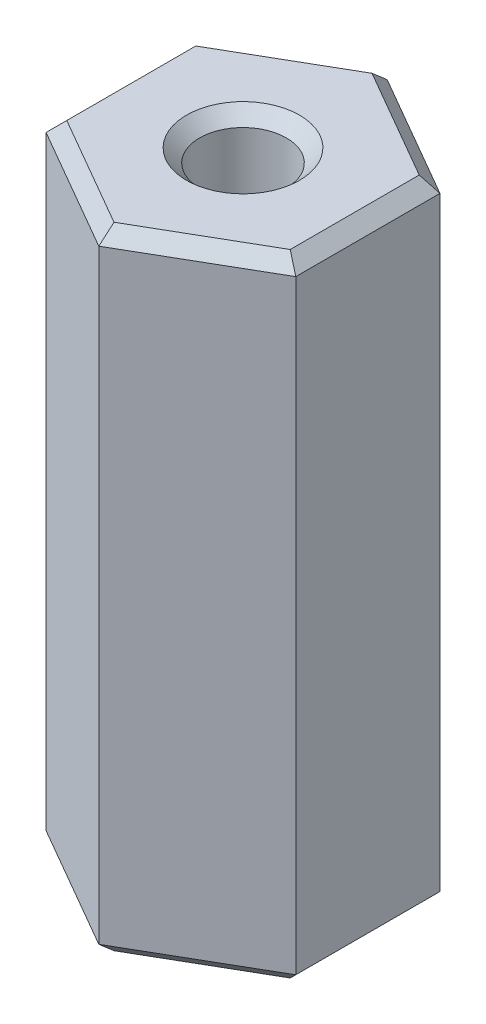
ISO-10303-21;
HEADER;
FILE_DESCRIPTION(('STEP AP214'),'2;1');
FILE_NAME('part.step','',(''),(''),'','','');
FILE_SCHEMA(('AUTOMOTIVE_DESIGN { 1 0 10303 214 1 1 1 1 }'));
ENDSEC;
DATA;
#1=APPLICATION_CONTEXT('core data for automotive mechanical design processes');
#2=APPLICATION_PROTOCOL_DEFINITION('international standard','automotive_design',2000,#1);
#3=PRODUCT_CONTEXT('',#1,'mechanical');
#4=PRODUCT('Part','Part','',(#3));
#5=PRODUCT_RELATED_PRODUCT_CATEGORY('part','',(#4));
#6=PRODUCT_DEFINITION_FORMATION('','',#4);
#7=PRODUCT_DEFINITION_CONTEXT('part definition',#1,'design');
#8=PRODUCT_DEFINITION('design','',#6,#7);
#9=PRODUCT_DEFINITION_SHAPE('','',#8);
#10=(LENGTH_UNIT() NAMED_UNIT(*) SI_UNIT(.MILLI.,.METRE.));
#11=(NAMED_UNIT(*) PLANE_ANGLE_UNIT() SI_UNIT($,.RADIAN.));
#12=(NAMED_UNIT(*) SI_UNIT($,.STERADIAN.) SOLID_ANGLE_UNIT());
#13=UNCERTAINTY_MEASURE_WITH_UNIT(LENGTH_MEASURE(1.E-05),#10,'distance_accuracy_value','');
#14=(GEOMETRIC_REPRESENTATION_CONTEXT(3) GLOBAL_UNCERTAINTY_ASSIGNED_CONTEXT((#13)) GLOBAL_UNIT_ASSIGNED_CONTEXT((#10,
#11,#12)) REPRESENTATION_CONTEXT('',''));
#15=CARTESIAN_POINT('',(0.,0.,0.));
#16=DIRECTION('',(0.,0.,1.));
#17=DIRECTION('',(1.,0.,0.));
#18=AXIS2_PLACEMENT_3D('',#15,#16,#17);
#19=CARTESIAN_POINT('',(-12.925,0.,0.));
#20=DIRECTION('',(0.,1.,0.));
#21=DIRECTION('',(0.,0.,1.));
#22=AXIS2_PLACEMENT_3D('',#19,#20,#21);
#23=PLANE('',#22);
#24=DIRECTION('',(0.,0.,-1.));
#25=VECTOR('',#24,1.);
#26=CARTESIAN_POINT('',(-8.49999999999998,0.,-5.48482755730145));
#27=LINE('',#26,#25);
#28=CARTESIAN_POINT('',(-8.49999999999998,0.,4.90747728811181));
#29=VERTEX_POINT('',#28);
#30=CARTESIAN_POINT('',(-8.49999999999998,0.,-4.90747728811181));
#31=VERTEX_POINT('',#30);
#32=EDGE_CURVE('E162',#29,#31,#27,.T.);
#33=ORIENTED_EDGE('',*,*,#32,.T.);
#34=DIRECTION('',(0.866025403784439,0.,-0.5));
#35=VECTOR('',#34,1.);
#36=CARTESIAN_POINT('',(0.500000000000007,0.,-10.1036297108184));
#37=LINE('',#36,#35);
#38=CARTESIAN_POINT('',(0.,0.,-9.81495457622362));
#39=VERTEX_POINT('',#38);
#40=EDGE_CURVE('E164',#31,#39,#37,.T.);
#41=ORIENTED_EDGE('',*,*,#40,.T.);
#42=DIRECTION('',(0.866025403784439,0.,0.5));
#43=VECTOR('',#42,1.);
#44=CARTESIAN_POINT('',(8.99999999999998,0.,-4.618802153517));
#45=LINE('',#44,#43);
#46=CARTESIAN_POINT('',(8.49999999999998,0.,-4.90747728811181));
#47=VERTEX_POINT('',#46);
#48=EDGE_CURVE('E154',#39,#47,#45,.T.);
#49=ORIENTED_EDGE('',*,*,#48,.T.);
#50=DIRECTION('',(0.,0.,1.));
#51=VECTOR('',#50,1.);
#52=CARTESIAN_POINT('',(8.49999999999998,0.,5.48482755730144));
#53=LINE('',#52,#51);
#54=CARTESIAN_POINT('',(8.49999999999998,0.,4.90747728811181));
#55=VERTEX_POINT('',#54);
#56=EDGE_CURVE('E156',#47,#55,#53,.T.);
#57=ORIENTED_EDGE('',*,*,#56,.T.);
#58=DIRECTION('',(-0.866025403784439,0.,0.5));
#59=VECTOR('',#58,1.);
#60=CARTESIAN_POINT('',(-0.50000000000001,0.,10.1036297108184));
#61=LINE('',#60,#59);
#62=CARTESIAN_POINT('',(0.,0.,9.81495457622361));
#63=VERTEX_POINT('',#62);
#64=EDGE_CURVE('E158',#55,#63,#61,.T.);
#65=ORIENTED_EDGE('',*,*,#64,.T.);
#66=DIRECTION('',(-0.866025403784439,0.,-0.5));
#67=VECTOR('',#66,1.);
#68=CARTESIAN_POINT('',(-8.99999999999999,0.,4.61880215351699));
#69=LINE('',#68,#67);
#70=EDGE_CURVE('E160',#63,#29,#69,.T.);
#71=ORIENTED_EDGE('',*,*,#70,.T.);
#72=EDGE_LOOP('',(#33,#41,#49,#57,#65,#71));
#73=FACE_BOUND('',#72,.T.);
#74=CARTESIAN_POINT('',(0.,0.,0.));
#75=DIRECTION('',(0.,1.,0.));
#76=DIRECTION('',(0.,0.,1.));
#77=AXIS2_PLACEMENT_3D('',#74,#75,#76);
#78=CIRCLE('',#77,3.925);
#79=CARTESIAN_POINT('',(0.,0.,3.925));
#80=VERTEX_POINT('',#79);
#81=EDGE_CURVE('E151',#80,#80,#78,.T.);
#82=ORIENTED_EDGE('',*,*,#81,.T.);
#83=EDGE_LOOP('',(#82));
#84=FACE_BOUND('',#83,.T.);
#85=ADVANCED_FACE('F34',(#73,#84),#23,.F.);
#86=CARTESIAN_POINT('',(0.,0.,0.));
#87=DIRECTION('',(0.,-1.,0.));
#88=DIRECTION('',(0.,0.,-1.));
#89=AXIS2_PLACEMENT_3D('',#86,#87,#88);
#90=CYLINDRICAL_SURFACE('',#89,2.925);
#91=CARTESIAN_POINT('',(0.,1.,0.));
#92=DIRECTION('',(0.,1.,0.));
#93=DIRECTION('',(0.,0.,1.));
#94=AXIS2_PLACEMENT_3D('',#91,#92,#93);
#95=CIRCLE('',#94,2.925);
#96=CARTESIAN_POINT('',(0.,1.,2.925));
#97=VERTEX_POINT('',#96);
#98=EDGE_CURVE('E188',#97,#97,#95,.F.);
#99=ORIENTED_EDGE('',*,*,#98,.T.);
#100=EDGE_LOOP('',(#99));
#101=FACE_BOUND('',#100,.T.);
#102=CARTESIAN_POINT('',(0.,20.,0.));
#103=DIRECTION('',(0.,-1.,0.));
#104=DIRECTION('',(0.,0.,-1.));
#105=AXIS2_PLACEMENT_3D('',#102,#103,#104);
#106=CIRCLE('',#105,2.925);
#107=CARTESIAN_POINT('',(0.,20.,-2.925));
#108=VERTEX_POINT('',#107);
#109=EDGE_CURVE('E137',#108,#108,#106,.T.);
#110=ORIENTED_EDGE('',*,*,#109,.F.);
#111=EDGE_LOOP('',(#110));
#112=FACE_BOUND('',#111,.T.);
#113=ADVANCED_FACE('F133',(#101,#112),#90,.F.);
#114=CARTESIAN_POINT('',(0.,20.,0.));
#115=DIRECTION('',(0.,-1.,0.));
#116=DIRECTION('',(0.,0.,-1.));
#117=AXIS2_PLACEMENT_3D('',#114,#115,#116);
#118=CONICAL_SURFACE('',#117,2.925,0.785398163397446);
#119=CARTESIAN_POINT('',(0.,22.925,0.));
#120=VERTEX_POINT('',#119);
#121=VERTEX_LOOP('',#120);
#122=FACE_BOUND('',#121,.T.);
#123=ORIENTED_EDGE('',*,*,#109,.T.);
#124=EDGE_LOOP('',(#123));
#125=FACE_BOUND('',#124,.T.);
#126=ADVANCED_FACE('F129',(#122,#125),#118,.F.);
#127=CARTESIAN_POINT('',(9.49999999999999,0.,-5.48482755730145));
#128=DIRECTION('',(0.5,0.,-0.866025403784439));
#129=DIRECTION('',(-0.866025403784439,0.,-0.5));
#130=AXIS2_PLACEMENT_3D('',#127,#128,#129);
#131=PLANE('',#130);
#132=DIRECTION('',(0.,1.,0.));
#133=VECTOR('',#132,1.);
#134=CARTESIAN_POINT('',(9.49999999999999,0.,-5.48482755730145));
#135=LINE('',#134,#133);
#136=CARTESIAN_POINT('',(9.49999999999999,1.00000000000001,-5.48482755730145));
#137=VERTEX_POINT('',#136);
#138=CARTESIAN_POINT('',(9.49999999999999,47.,-5.48482755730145));
#139=VERTEX_POINT('',#138);
#140=EDGE_CURVE('E145',#137,#139,#135,.T.);
#141=ORIENTED_EDGE('',*,*,#140,.F.);
#142=DIRECTION('',(-0.866025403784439,0.,-0.5));
#143=VECTOR('',#142,1.);
#144=CARTESIAN_POINT('',(0.,1.00000000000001,-10.9696551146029));
#145=LINE('',#144,#143);
#146=CARTESIAN_POINT('',(0.,1.00000000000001,-10.9696551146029));
#147=VERTEX_POINT('',#146);
#148=EDGE_CURVE('E186',#137,#147,#145,.T.);
#149=ORIENTED_EDGE('',*,*,#148,.T.);
#150=DIRECTION('',(0.,1.,0.));
#151=VECTOR('',#150,1.);
#152=CARTESIAN_POINT('',(0.,0.,-10.9696551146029));
#153=LINE('',#152,#151);
#154=CARTESIAN_POINT('',(0.,47.,-10.9696551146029));
#155=VERTEX_POINT('',#154);
#156=EDGE_CURVE('E219',#147,#155,#153,.T.);
#157=ORIENTED_EDGE('',*,*,#156,.T.);
#158=DIRECTION('',(0.866025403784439,0.,0.5));
#159=VECTOR('',#158,1.);
#160=CARTESIAN_POINT('',(9.49999999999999,47.,-5.48482755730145));
#161=LINE('',#160,#159);
#162=EDGE_CURVE('E184',#155,#139,#161,.T.);
#163=ORIENTED_EDGE('',*,*,#162,.T.);
#164=EDGE_LOOP('',(#141,#149,#157,#163));
#165=FACE_BOUND('',#164,.T.);
#166=ADVANCED_FACE('F132',(#165),#131,.T.);
#167=CARTESIAN_POINT('',(9.49999999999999,0.,5.48482755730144));
#168=DIRECTION('',(1.,0.,0.));
#169=DIRECTION('',(0.,0.,-1.));
#170=AXIS2_PLACEMENT_3D('',#167,#168,#169);
#171=PLANE('',#170);
#172=DIRECTION('',(0.,1.,0.));
#173=VECTOR('',#172,1.);
#174=CARTESIAN_POINT('',(9.49999999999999,0.,5.48482755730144));
#175=LINE('',#174,#173);
#176=CARTESIAN_POINT('',(9.49999999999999,1.00000000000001,5.48482755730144));
#177=VERTEX_POINT('',#176);
#178=CARTESIAN_POINT('',(9.49999999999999,47.,5.48482755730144));
#179=VERTEX_POINT('',#178);
#180=EDGE_CURVE('E264',#177,#179,#175,.T.);
#181=ORIENTED_EDGE('',*,*,#180,.F.);
#182=DIRECTION('',(0.,0.,-1.));
#183=VECTOR('',#182,1.);
#184=CARTESIAN_POINT('',(9.49999999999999,1.00000000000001,-5.48482755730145));
#185=LINE('',#184,#183);
#186=EDGE_CURVE('E182',#177,#137,#185,.T.);
#187=ORIENTED_EDGE('',*,*,#186,.T.);
#188=ORIENTED_EDGE('',*,*,#140,.T.);
#189=DIRECTION('',(0.,0.,1.));
#190=VECTOR('',#189,1.);
#191=CARTESIAN_POINT('',(9.49999999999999,47.,5.48482755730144));
#192=LINE('',#191,#190);
#193=EDGE_CURVE('E179',#139,#179,#192,.T.);
#194=ORIENTED_EDGE('',*,*,#193,.T.);
#195=EDGE_LOOP('',(#181,#187,#188,#194));
#196=FACE_BOUND('',#195,.T.);
#197=ADVANCED_FACE('F261',(#196),#171,.T.);
#198=CARTESIAN_POINT('',(0.,0.,10.9696551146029));
#199=DIRECTION('',(0.5,0.,0.866025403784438));
#200=DIRECTION('',(0.866025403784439,0.,-0.5));
#201=AXIS2_PLACEMENT_3D('',#198,#199,#200);
#202=PLANE('',#201);
#203=DIRECTION('',(0.,1.,0.));
#204=VECTOR('',#203,1.);
#205=CARTESIAN_POINT('',(0.,0.,10.9696551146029));
#206=LINE('',#205,#204);
#207=CARTESIAN_POINT('',(0.,1.00000000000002,10.9696551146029));
#208=VERTEX_POINT('',#207);
#209=CARTESIAN_POINT('',(0.,47.,10.9696551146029));
#210=VERTEX_POINT('',#209);
#211=EDGE_CURVE('E266',#208,#210,#206,.T.);
#212=ORIENTED_EDGE('',*,*,#211,.F.);
#213=DIRECTION('',(0.866025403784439,0.,-0.5));
#214=VECTOR('',#213,1.);
#215=CARTESIAN_POINT('',(9.49999999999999,1.00000000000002,5.48482755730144));
#216=LINE('',#215,#214);
#217=EDGE_CURVE('E177',#208,#177,#216,.T.);
#218=ORIENTED_EDGE('',*,*,#217,.T.);
#219=ORIENTED_EDGE('',*,*,#180,.T.);
#220=DIRECTION('',(-0.866025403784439,0.,0.5));
#221=VECTOR('',#220,1.);
#222=CARTESIAN_POINT('',(0.,47.,10.9696551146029));
#223=LINE('',#222,#221);
#224=EDGE_CURVE('E175',#179,#210,#223,.T.);
#225=ORIENTED_EDGE('',*,*,#224,.T.);
#226=EDGE_LOOP('',(#212,#218,#219,#225));
#227=FACE_BOUND('',#226,.T.);
#228=ADVANCED_FACE('F316',(#227),#202,.T.);
#229=CARTESIAN_POINT('',(-9.5,0.,5.48482755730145));
#230=DIRECTION('',(-0.5,0.,0.866025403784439));
#231=DIRECTION('',(0.866025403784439,0.,0.5));
#232=AXIS2_PLACEMENT_3D('',#229,#230,#231);
#233=PLANE('',#232);
#234=DIRECTION('',(0.,1.,0.));
#235=VECTOR('',#234,1.);
#236=CARTESIAN_POINT('',(-9.5,0.,5.48482755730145));
#237=LINE('',#236,#235);
#238=CARTESIAN_POINT('',(-9.5,1.00000000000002,5.48482755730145));
#239=VERTEX_POINT('',#238);
#240=CARTESIAN_POINT('',(-9.5,47.,5.48482755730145));
#241=VERTEX_POINT('',#240);
#242=EDGE_CURVE('E271',#239,#241,#237,.T.);
#243=ORIENTED_EDGE('',*,*,#242,.F.);
#244=DIRECTION('',(0.866025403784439,0.,0.5));
#245=VECTOR('',#244,1.);
#246=CARTESIAN_POINT('',(0.,1.00000000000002,10.9696551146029));
#247=LINE('',#246,#245);
#248=EDGE_CURVE('E173',#239,#208,#247,.T.);
#249=ORIENTED_EDGE('',*,*,#248,.T.);
#250=ORIENTED_EDGE('',*,*,#211,.T.);
#251=DIRECTION('',(-0.866025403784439,0.,-0.5));
#252=VECTOR('',#251,1.);
#253=CARTESIAN_POINT('',(-9.5,47.,5.48482755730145));
#254=LINE('',#253,#252);
#255=EDGE_CURVE('E171',#210,#241,#254,.T.);
#256=ORIENTED_EDGE('',*,*,#255,.T.);
#257=EDGE_LOOP('',(#243,#249,#250,#256));
#258=FACE_BOUND('',#257,.T.);
#259=ADVANCED_FACE('F286',(#258),#233,.T.);
#260=CARTESIAN_POINT('',(-9.5,0.,-5.48482755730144));
#261=DIRECTION('',(-1.,0.,0.));
#262=DIRECTION('',(0.,0.,1.));
#263=AXIS2_PLACEMENT_3D('',#260,#261,#262);
#264=PLANE('',#263);
#265=DIRECTION('',(0.,1.,0.));
#266=VECTOR('',#265,1.);
#267=CARTESIAN_POINT('',(-9.5,0.,-5.48482755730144));
#268=LINE('',#267,#266);
#269=CARTESIAN_POINT('',(-9.5,1.00000000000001,-5.48482755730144));
#270=VERTEX_POINT('',#269);
#271=CARTESIAN_POINT('',(-9.5,47.,-5.48482755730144));
#272=VERTEX_POINT('',#271);
#273=EDGE_CURVE('E274',#270,#272,#268,.T.);
#274=ORIENTED_EDGE('',*,*,#273,.F.);
#275=DIRECTION('',(0.,0.,1.));
#276=VECTOR('',#275,1.);
#277=CARTESIAN_POINT('',(-9.5,1.00000000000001,5.48482755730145));
#278=LINE('',#277,#276);
#279=EDGE_CURVE('E169',#270,#239,#278,.T.);
#280=ORIENTED_EDGE('',*,*,#279,.T.);
#281=ORIENTED_EDGE('',*,*,#242,.T.);
#282=DIRECTION('',(0.,0.,-1.));
#283=VECTOR('',#282,1.);
#284=CARTESIAN_POINT('',(-9.5,47.,-5.48482755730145));
#285=LINE('',#284,#283);
#286=EDGE_CURVE('E167',#241,#272,#285,.T.);
#287=ORIENTED_EDGE('',*,*,#286,.T.);
#288=EDGE_LOOP('',(#274,#280,#281,#287));
#289=FACE_BOUND('',#288,.T.);
#290=ADVANCED_FACE('F281',(#289),#264,.T.);
#291=CARTESIAN_POINT('',(0.,0.,-10.9696551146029));
#292=DIRECTION('',(-0.5,0.,-0.866025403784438));
#293=DIRECTION('',(-0.866025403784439,0.,0.5));
#294=AXIS2_PLACEMENT_3D('',#291,#292,#293);
#295=PLANE('',#294);
#296=ORIENTED_EDGE('',*,*,#156,.F.);
#297=DIRECTION('',(-0.866025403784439,0.,0.5));
#298=VECTOR('',#297,1.);
#299=CARTESIAN_POINT('',(-9.5,1.00000000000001,-5.48482755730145));
#300=LINE('',#299,#298);
#301=EDGE_CURVE('E142',#147,#270,#300,.T.);
#302=ORIENTED_EDGE('',*,*,#301,.T.);
#303=ORIENTED_EDGE('',*,*,#273,.T.);
#304=DIRECTION('',(0.866025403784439,0.,-0.5));
#305=VECTOR('',#304,1.);
#306=CARTESIAN_POINT('',(0.,47.,-10.9696551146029));
#307=LINE('',#306,#305);
#308=EDGE_CURVE('E139',#272,#155,#307,.T.);
#309=ORIENTED_EDGE('',*,*,#308,.T.);
#310=EDGE_LOOP('',(#296,#302,#303,#309));
#311=FACE_BOUND('',#310,.T.);
#312=ADVANCED_FACE('F278',(#311),#295,.T.);
#313=CARTESIAN_POINT('',(0.,24.7,0.));
#314=DIRECTION('',(0.,1.,0.));
#315=DIRECTION('',(0.,0.,1.));
#316=AXIS2_PLACEMENT_3D('',#313,#314,#315);
#317=CONICAL_SURFACE('',#316,0.,0.78539816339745);
#318=CARTESIAN_POINT('',(0.,28.,0.));
#319=DIRECTION('',(0.,-1.,0.));
#320=DIRECTION('',(0.,0.,-1.));
#321=AXIS2_PLACEMENT_3D('',#318,#319,#320);
#322=CIRCLE('',#321,3.3);
#323=CARTESIAN_POINT('',(0.,28.,-3.3));
#324=VERTEX_POINT('',#323);
#325=EDGE_CURVE('E140',#324,#324,#322,.T.);
#326=ORIENTED_EDGE('',*,*,#325,.F.);
#327=EDGE_LOOP('',(#326));
#328=FACE_BOUND('',#327,.T.);
#329=CARTESIAN_POINT('',(0.,24.7,0.));
#330=VERTEX_POINT('',#329);
#331=VERTEX_LOOP('',#330);
#332=FACE_BOUND('',#331,.T.);
#333=ADVANCED_FACE('F447',(#328,#332),#317,.F.);
#334=CARTESIAN_POINT('',(0.,0.,0.));
#335=DIRECTION('',(0.,-1.,0.));
#336=DIRECTION('',(0.,0.,-1.));
#337=AXIS2_PLACEMENT_3D('',#334,#335,#336);
#338=CYLINDRICAL_SURFACE('',#337,3.3);
#339=CARTESIAN_POINT('',(0.,47.,0.));
#340=DIRECTION('',(0.,-1.,0.));
#341=DIRECTION('',(0.,0.,-1.));
#342=AXIS2_PLACEMENT_3D('',#339,#340,#341);
#343=CIRCLE('',#342,3.3);
#344=CARTESIAN_POINT('',(0.,47.,-3.3));
#345=VERTEX_POINT('',#344);
#346=EDGE_CURVE('E12',#345,#345,#343,.F.);
#347=ORIENTED_EDGE('',*,*,#346,.T.);
#348=EDGE_LOOP('',(#347));
#349=FACE_BOUND('',#348,.T.);
#350=ORIENTED_EDGE('',*,*,#325,.T.);
#351=EDGE_LOOP('',(#350));
#352=FACE_BOUND('',#351,.T.);
#353=ADVANCED_FACE('F496',(#349,#352),#338,.F.);
#354=CARTESIAN_POINT('',(-3.3,48.,0.));
#355=DIRECTION('',(0.,-1.,0.));
#356=DIRECTION('',(0.,0.,-1.));
#357=AXIS2_PLACEMENT_3D('',#354,#355,#356);
#358=PLANE('',#357);
#359=DIRECTION('',(0.866025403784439,0.,-0.5));
#360=VECTOR('',#359,1.);
#361=CARTESIAN_POINT('',(8.99999999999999,48.,4.618802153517));
#362=LINE('',#361,#360);
#363=CARTESIAN_POINT('',(0.,48.,9.81495457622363));
#364=VERTEX_POINT('',#363);
#365=CARTESIAN_POINT('',(8.49999999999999,48.,4.90747728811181));
#366=VERTEX_POINT('',#365);
#367=EDGE_CURVE('E51',#364,#366,#362,.T.);
#368=ORIENTED_EDGE('',*,*,#367,.T.);
#369=DIRECTION('',(0.,0.,-1.));
#370=VECTOR('',#369,1.);
#371=CARTESIAN_POINT('',(8.49999999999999,48.,-5.48482755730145));
#372=LINE('',#371,#370);
#373=CARTESIAN_POINT('',(8.49999999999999,48.,-4.90747728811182));
#374=VERTEX_POINT('',#373);
#375=EDGE_CURVE('E43',#366,#374,#372,.T.);
#376=ORIENTED_EDGE('',*,*,#375,.T.);
#377=DIRECTION('',(-0.866025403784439,0.,-0.5));
#378=VECTOR('',#377,1.);
#379=CARTESIAN_POINT('',(-0.500000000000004,48.,-10.1036297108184));
#380=LINE('',#379,#378);
#381=CARTESIAN_POINT('',(0.,48.,-9.81495457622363));
#382=VERTEX_POINT('',#381);
#383=EDGE_CURVE('E194',#374,#382,#380,.T.);
#384=ORIENTED_EDGE('',*,*,#383,.T.);
#385=DIRECTION('',(-0.866025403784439,0.,0.5));
#386=VECTOR('',#385,1.);
#387=CARTESIAN_POINT('',(-9.,48.,-4.618802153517));
#388=LINE('',#387,#386);
#389=CARTESIAN_POINT('',(-8.49999999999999,48.,-4.90747728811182));
#390=VERTEX_POINT('',#389);
#391=EDGE_CURVE('E196',#382,#390,#388,.T.);
#392=ORIENTED_EDGE('',*,*,#391,.T.);
#393=DIRECTION('',(0.,0.,1.));
#394=VECTOR('',#393,1.);
#395=CARTESIAN_POINT('',(-8.49999999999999,48.,5.48482755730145));
#396=LINE('',#395,#394);
#397=CARTESIAN_POINT('',(-8.49999999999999,48.,4.90747728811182));
#398=VERTEX_POINT('',#397);
#399=EDGE_CURVE('E198',#390,#398,#396,.T.);
#400=ORIENTED_EDGE('',*,*,#399,.T.);
#401=DIRECTION('',(0.866025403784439,0.,0.5));
#402=VECTOR('',#401,1.);
#403=CARTESIAN_POINT('',(0.500000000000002,48.,10.1036297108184));
#404=LINE('',#403,#402);
#405=EDGE_CURVE('E56',#398,#364,#404,.T.);
#406=ORIENTED_EDGE('',*,*,#405,.T.);
#407=EDGE_LOOP('',(#368,#376,#384,#392,#400,#406));
#408=FACE_BOUND('',#407,.T.);
#409=CARTESIAN_POINT('',(0.,48.,0.));
#410=DIRECTION('',(0.,-1.,0.));
#411=DIRECTION('',(0.,0.,-1.));
#412=AXIS2_PLACEMENT_3D('',#409,#410,#411);
#413=CIRCLE('',#412,4.30000000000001);
#414=CARTESIAN_POINT('',(0.,48.,-4.30000000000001));
#415=VERTEX_POINT('',#414);
#416=EDGE_CURVE('E191',#415,#415,#413,.T.);
#417=ORIENTED_EDGE('',*,*,#416,.T.);
#418=EDGE_LOOP('',(#417));
#419=FACE_BOUND('',#418,.T.);
#420=ADVANCED_FACE('F245',(#408,#419),#358,.F.);
#421=CARTESIAN_POINT('',(0.,1.00000000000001,10.9696551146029));
#422=DIRECTION('',(0.353553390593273,-0.707106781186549,0.612372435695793));
#423=DIRECTION('',(-0.866025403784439,0.,0.5));
#424=AXIS2_PLACEMENT_3D('',#421,#422,#423);
#425=PLANE('',#424);
#426=DIRECTION('',(0.,-0.654653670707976,-0.755928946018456));
#427=VECTOR('',#426,1.);
#428=CARTESIAN_POINT('',(0.,1.00000000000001,10.9696551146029));
#429=LINE('',#428,#427);
#430=EDGE_CURVE('E213',#63,#208,#429,.F.);
#431=ORIENTED_EDGE('',*,*,#430,.F.);
#432=ORIENTED_EDGE('',*,*,#64,.F.);
#433=DIRECTION('',(-0.654653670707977,-0.654653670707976,-0.377964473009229));
#434=VECTOR('',#433,1.);
#435=CARTESIAN_POINT('',(9.49999999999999,1.00000000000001,5.48482755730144));
#436=LINE('',#435,#434);
#437=EDGE_CURVE('E216',#177,#55,#436,.T.);
#438=ORIENTED_EDGE('',*,*,#437,.F.);
#439=ORIENTED_EDGE('',*,*,#217,.F.);
#440=EDGE_LOOP('',(#431,#432,#438,#439));
#441=FACE_BOUND('',#440,.T.);
#442=ADVANCED_FACE('F314',(#441),#425,.T.);
#443=CARTESIAN_POINT('',(9.49999999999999,1.00000000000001,5.48482755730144));
#444=DIRECTION('',(0.707106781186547,-0.707106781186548,0.));
#445=DIRECTION('',(0.,0.,1.));
#446=AXIS2_PLACEMENT_3D('',#443,#444,#445);
#447=PLANE('',#446);
#448=ORIENTED_EDGE('',*,*,#437,.T.);
#449=ORIENTED_EDGE('',*,*,#56,.F.);
#450=DIRECTION('',(-0.654653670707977,-0.654653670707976,0.377964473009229));
#451=VECTOR('',#450,1.);
#452=CARTESIAN_POINT('',(9.49999999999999,1.00000000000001,-5.48482755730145));
#453=LINE('',#452,#451);
#454=EDGE_CURVE('E210',#137,#47,#453,.T.);
#455=ORIENTED_EDGE('',*,*,#454,.F.);
#456=ORIENTED_EDGE('',*,*,#186,.F.);
#457=EDGE_LOOP('',(#448,#449,#455,#456));
#458=FACE_BOUND('',#457,.T.);
#459=ADVANCED_FACE('F310',(#458),#447,.T.);
#460=CARTESIAN_POINT('',(-9.5,1.00000000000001,5.48482755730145));
#461=DIRECTION('',(-0.353553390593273,-0.707106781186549,0.612372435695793));
#462=DIRECTION('',(-0.866025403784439,0.,-0.5));
#463=AXIS2_PLACEMENT_3D('',#460,#461,#462);
#464=PLANE('',#463);
#465=ORIENTED_EDGE('',*,*,#430,.T.);
#466=ORIENTED_EDGE('',*,*,#248,.F.);
#467=DIRECTION('',(0.654653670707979,-0.654653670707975,-0.377964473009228));
#468=VECTOR('',#467,1.);
#469=CARTESIAN_POINT('',(-9.5,1.00000000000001,5.48482755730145));
#470=LINE('',#469,#468);
#471=EDGE_CURVE('E207',#29,#239,#470,.F.);
#472=ORIENTED_EDGE('',*,*,#471,.F.);
#473=ORIENTED_EDGE('',*,*,#70,.F.);
#474=EDGE_LOOP('',(#465,#466,#472,#473));
#475=FACE_BOUND('',#474,.T.);
#476=ADVANCED_FACE('F290',(#475),#464,.T.);
#477=CARTESIAN_POINT('',(9.49999999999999,1.00000000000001,-5.48482755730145));
#478=DIRECTION('',(0.353553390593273,-0.707106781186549,-0.612372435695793));
#479=DIRECTION('',(0.866025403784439,0.,0.5));
#480=AXIS2_PLACEMENT_3D('',#477,#478,#479);
#481=PLANE('',#480);
#482=ORIENTED_EDGE('',*,*,#454,.T.);
#483=ORIENTED_EDGE('',*,*,#48,.F.);
#484=DIRECTION('',(0.,0.654653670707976,-0.755928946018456));
#485=VECTOR('',#484,1.);
#486=CARTESIAN_POINT('',(0.,-1.71428571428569,-7.83546793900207));
#487=LINE('',#486,#485);
#488=EDGE_CURVE('E205',#147,#39,#487,.F.);
#489=ORIENTED_EDGE('',*,*,#488,.F.);
#490=ORIENTED_EDGE('',*,*,#148,.F.);
#491=EDGE_LOOP('',(#482,#483,#489,#490));
#492=FACE_BOUND('',#491,.T.);
#493=ADVANCED_FACE('F306',(#492),#481,.T.);
#494=CARTESIAN_POINT('',(-9.5,1.00000000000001,-5.48482755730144));
#495=DIRECTION('',(-0.707106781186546,-0.707106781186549,0.));
#496=DIRECTION('',(0.,0.,-1.));
#497=AXIS2_PLACEMENT_3D('',#494,#495,#496);
#498=PLANE('',#497);
#499=ORIENTED_EDGE('',*,*,#471,.T.);
#500=ORIENTED_EDGE('',*,*,#279,.F.);
#501=DIRECTION('',(0.654653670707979,-0.654653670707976,0.377964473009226));
#502=VECTOR('',#501,1.);
#503=CARTESIAN_POINT('',(-9.5,1.00000000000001,-5.48482755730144));
#504=LINE('',#503,#502);
#505=EDGE_CURVE('E203',#31,#270,#504,.F.);
#506=ORIENTED_EDGE('',*,*,#505,.F.);
#507=ORIENTED_EDGE('',*,*,#32,.F.);
#508=EDGE_LOOP('',(#499,#500,#506,#507));
#509=FACE_BOUND('',#508,.T.);
#510=ADVANCED_FACE('F295',(#509),#498,.T.);
#511=CARTESIAN_POINT('',(0.,1.00000000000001,-10.9696551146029));
#512=DIRECTION('',(-0.353553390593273,-0.707106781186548,-0.612372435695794));
#513=DIRECTION('',(0.866025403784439,0.,-0.5));
#514=AXIS2_PLACEMENT_3D('',#511,#512,#513);
#515=PLANE('',#514);
#516=ORIENTED_EDGE('',*,*,#488,.T.);
#517=ORIENTED_EDGE('',*,*,#40,.F.);
#518=ORIENTED_EDGE('',*,*,#505,.T.);
#519=ORIENTED_EDGE('',*,*,#301,.F.);
#520=EDGE_LOOP('',(#516,#517,#518,#519));
#521=FACE_BOUND('',#520,.T.);
#522=ADVANCED_FACE('F301',(#521),#515,.T.);
#523=CARTESIAN_POINT('',(0.,1.,0.));
#524=DIRECTION('',(0.,-1.,0.));
#525=DIRECTION('',(0.,0.,-1.));
#526=AXIS2_PLACEMENT_3D('',#523,#524,#525);
#527=CONICAL_SURFACE('',#526,2.925,0.78539816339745);
#528=ORIENTED_EDGE('',*,*,#81,.F.);
#529=EDGE_LOOP('',(#528));
#530=FACE_BOUND('',#529,.T.);
#531=ORIENTED_EDGE('',*,*,#98,.F.);
#532=EDGE_LOOP('',(#531));
#533=FACE_BOUND('',#532,.T.);
#534=ADVANCED_FACE('F343',(#530,#533),#527,.F.);
#535=CARTESIAN_POINT('',(-9.5,47.,-5.48482755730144));
#536=DIRECTION('',(-0.707106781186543,0.707106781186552,0.));
#537=DIRECTION('',(0.,0.,1.));
#538=AXIS2_PLACEMENT_3D('',#535,#536,#537);
#539=PLANE('',#538);
#540=DIRECTION('',(0.654653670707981,0.654653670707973,-0.377964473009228));
#541=VECTOR('',#540,1.);
#542=CARTESIAN_POINT('',(-6.78571428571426,49.7142857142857,3.91773396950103));
#543=LINE('',#542,#541);
#544=EDGE_CURVE('E229',#398,#241,#543,.F.);
#545=ORIENTED_EDGE('',*,*,#544,.F.);
#546=ORIENTED_EDGE('',*,*,#399,.F.);
#547=DIRECTION('',(0.654653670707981,0.654653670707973,0.377964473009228));
#548=VECTOR('',#547,1.);
#549=CARTESIAN_POINT('',(-6.78571428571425,49.7142857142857,-3.91773396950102));
#550=LINE('',#549,#548);
#551=EDGE_CURVE('E38',#272,#390,#550,.T.);
#552=ORIENTED_EDGE('',*,*,#551,.F.);
#553=ORIENTED_EDGE('',*,*,#286,.F.);
#554=EDGE_LOOP('',(#545,#546,#552,#553));
#555=FACE_BOUND('',#554,.T.);
#556=ADVANCED_FACE('F244',(#555),#539,.T.);
#557=CARTESIAN_POINT('',(0.,47.,-10.9696551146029));
#558=DIRECTION('',(-0.353553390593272,0.707106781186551,-0.612372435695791));
#559=DIRECTION('',(-0.866025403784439,0.,0.5));
#560=AXIS2_PLACEMENT_3D('',#557,#558,#559);
#561=PLANE('',#560);
#562=ORIENTED_EDGE('',*,*,#551,.T.);
#563=ORIENTED_EDGE('',*,*,#391,.F.);
#564=DIRECTION('',(0.,0.654653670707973,0.755928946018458));
#565=VECTOR('',#564,1.);
#566=CARTESIAN_POINT('',(0.,49.7142857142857,-7.83546793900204));
#567=LINE('',#566,#565);
#568=EDGE_CURVE('E227',#155,#382,#567,.T.);
#569=ORIENTED_EDGE('',*,*,#568,.F.);
#570=ORIENTED_EDGE('',*,*,#308,.F.);
#571=EDGE_LOOP('',(#562,#563,#569,#570));
#572=FACE_BOUND('',#571,.T.);
#573=ADVANCED_FACE('F239',(#572),#561,.T.);
#574=CARTESIAN_POINT('',(-9.5,47.,5.48482755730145));
#575=DIRECTION('',(-0.353553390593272,0.707106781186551,0.612372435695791));
#576=DIRECTION('',(0.866025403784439,0.,0.5));
#577=AXIS2_PLACEMENT_3D('',#574,#575,#576);
#578=PLANE('',#577);
#579=ORIENTED_EDGE('',*,*,#544,.T.);
#580=ORIENTED_EDGE('',*,*,#255,.F.);
#581=DIRECTION('',(0.,0.654653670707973,-0.755928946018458));
#582=VECTOR('',#581,1.);
#583=CARTESIAN_POINT('',(0.,49.7142857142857,7.83546793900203));
#584=LINE('',#583,#582);
#585=EDGE_CURVE('E224',#364,#210,#584,.F.);
#586=ORIENTED_EDGE('',*,*,#585,.F.);
#587=ORIENTED_EDGE('',*,*,#405,.F.);
#588=EDGE_LOOP('',(#579,#580,#586,#587));
#589=FACE_BOUND('',#588,.T.);
#590=ADVANCED_FACE('F318',(#589),#578,.T.);
#591=CARTESIAN_POINT('',(9.49999999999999,47.,-5.48482755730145));
#592=DIRECTION('',(0.353553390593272,0.707106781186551,-0.612372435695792));
#593=DIRECTION('',(-0.866025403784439,0.,-0.5));
#594=AXIS2_PLACEMENT_3D('',#591,#592,#593);
#595=PLANE('',#594);
#596=ORIENTED_EDGE('',*,*,#568,.T.);
#597=ORIENTED_EDGE('',*,*,#383,.F.);
#598=DIRECTION('',(0.654653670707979,-0.654653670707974,-0.37796447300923));
#599=VECTOR('',#598,1.);
#600=CARTESIAN_POINT('',(9.49999999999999,47.,-5.48482755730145));
#601=LINE('',#600,#599);
#602=EDGE_CURVE('E222',#139,#374,#601,.F.);
#603=ORIENTED_EDGE('',*,*,#602,.F.);
#604=ORIENTED_EDGE('',*,*,#162,.F.);
#605=EDGE_LOOP('',(#596,#597,#603,#604));
#606=FACE_BOUND('',#605,.T.);
#607=ADVANCED_FACE('F250',(#606),#595,.T.);
#608=CARTESIAN_POINT('',(0.,47.,10.9696551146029));
#609=DIRECTION('',(0.353553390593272,0.707106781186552,0.612372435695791));
#610=DIRECTION('',(0.866025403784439,0.,-0.5));
#611=AXIS2_PLACEMENT_3D('',#608,#609,#610);
#612=PLANE('',#611);
#613=ORIENTED_EDGE('',*,*,#585,.T.);
#614=ORIENTED_EDGE('',*,*,#224,.F.);
#615=DIRECTION('',(-0.654653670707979,0.654653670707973,-0.37796447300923));
#616=VECTOR('',#615,1.);
#617=CARTESIAN_POINT('',(6.78571428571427,49.7142857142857,3.91773396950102));
#618=LINE('',#617,#616);
#619=EDGE_CURVE('E220',#366,#179,#618,.F.);
#620=ORIENTED_EDGE('',*,*,#619,.F.);
#621=ORIENTED_EDGE('',*,*,#367,.F.);
#622=EDGE_LOOP('',(#613,#614,#620,#621));
#623=FACE_BOUND('',#622,.T.);
#624=ADVANCED_FACE('F320',(#623),#612,.T.);
#625=CARTESIAN_POINT('',(9.49999999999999,47.,5.48482755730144));
#626=DIRECTION('',(0.707106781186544,0.707106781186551,0.));
#627=DIRECTION('',(0.,0.,-1.));
#628=AXIS2_PLACEMENT_3D('',#625,#626,#627);
#629=PLANE('',#628);
#630=ORIENTED_EDGE('',*,*,#602,.T.);
#631=ORIENTED_EDGE('',*,*,#375,.F.);
#632=ORIENTED_EDGE('',*,*,#619,.T.);
#633=ORIENTED_EDGE('',*,*,#193,.F.);
#634=EDGE_LOOP('',(#630,#631,#632,#633));
#635=FACE_BOUND('',#634,.T.);
#636=ADVANCED_FACE('F323',(#635),#629,.T.);
#637=CARTESIAN_POINT('',(0.,48.,0.));
#638=DIRECTION('',(0.,1.,0.));
#639=DIRECTION('',(0.,0.,1.));
#640=AXIS2_PLACEMENT_3D('',#637,#638,#639);
#641=CONICAL_SURFACE('',#640,4.30000000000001,0.785398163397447);
#642=ORIENTED_EDGE('',*,*,#346,.F.);
#643=EDGE_LOOP('',(#642));
#644=FACE_BOUND('',#643,.T.);
#645=ORIENTED_EDGE('',*,*,#416,.F.);
#646=EDGE_LOOP('',(#645));
#647=FACE_BOUND('',#646,.T.);
#648=ADVANCED_FACE('F36',(#644,#647),#641,.F.);
#649=CLOSED_SHELL('',(#85,#113,#126,#166,#197,#228,#259,#290,#312,#333,#353,#420,#442,#459,#476,
#493,#510,#522,#534,#556,#573,#590,#607,#624,#636,#648));
#650=MANIFOLD_SOLID_BREP('B2',#649);
#651=ADVANCED_BREP_SHAPE_REPRESENTATION('',(#18,#650),#14);
#652=SHAPE_DEFINITION_REPRESENTATION(#9,#651);
ENDSEC;
END-ISO-10303-21;
